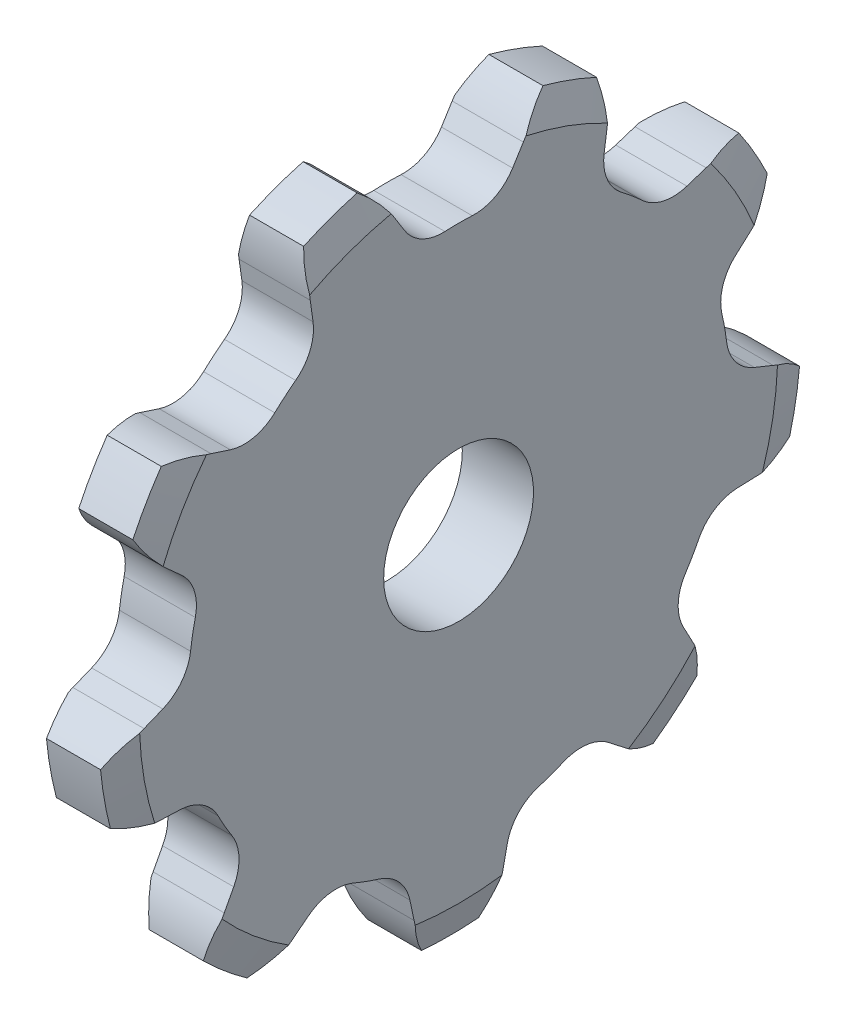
from build123d import *

# Parameters (mm, degrees)
TOOTHCUT_DEPTH  = 171.054362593
TEETHCUTS_COUNT = 9
TEETHCUTS_ANGLE = 320
BORSKE_R        = 25.4
BORE_DEPTH      = 76.2000508


with BuildPart() as part:
    # BasProSke → Base-Revolve (revolve)
    with BuildSketch(Plane(origin=(0, 0, 0), x_dir=(1, 0, 0), z_dir=(0, 1, 0)), mode=Mode.PRIVATE) as base_revolve_sk:
        Polygon((0, 0), (0, 108.223363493), (2.8956, 119.029889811), (21.2344, 119.029889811), (24.13, 108.223363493), (24.13, 0), align=None)
    revolve(base_revolve_sk.sketch.rotate(Axis((-10, 0, 0), (1, 0, 0)), 180), axis=Axis((-10, 0, 0), (1, 0, 0)))

    # TooCutSke → ToothCut (cut, through all)
    with BuildSketch(Plane(origin=(0, 0, 0), x_dir=(0, 0, -1), z_dir=(1, 0, 0))):
        with BuildLine():
            Line((-18.325370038, 98.612349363), (-21.959556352, 104.428263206))
            ThreePointArc((-21.959556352, 104.428263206), (-31.443843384, 114.743551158), (-44.015812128, 120.932449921))
            Line((-44.015812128, 120.932449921), (-48.359467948, 132.866546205))
            ThreePointArc((-48.359467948, 132.866546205), (0, 141.393625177), (48.359467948, 132.866546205))
            Line((48.359467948, 132.866546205), (44.015812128, 120.932449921))
            ThreePointArc((44.015812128, 120.932449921), (31.443843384, 114.743551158), (21.959556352, 104.428263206))
            Line((21.959556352, 104.428263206), (18.325370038, 98.612349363))
            ThreePointArc((18.325370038, 98.612349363), (12.450179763, 93.176534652), (4.630575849, 91.467810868))
            ThreePointArc((4.630575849, 91.467810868), (0, 91.584947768), (-4.630575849, 91.467810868))
            ThreePointArc((-4.630575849, 91.467810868), (-12.450179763, 93.176534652), (-18.325370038, 98.612349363))
        make_face()
    toothcut = extrude(amount=TOOTHCUT_DEPTH, mode=Mode.SUBTRACT)

    # TeethCuts: ToothCut ×9 about axis
    teethcuts_axis = Axis((-10, 0, 0), (1, 0, 0))
    for i in range(1, TEETHCUTS_COUNT):
        add(toothcut.rotate(teethcuts_axis, i * TEETHCUTS_ANGLE / (TEETHCUTS_COUNT - 1)), mode=Mode.SUBTRACT)

    # BorSke → Bore (cut, symmetric)
    with BuildSketch(Plane(origin=(0, 0, 0), x_dir=(0, 0, -1), z_dir=(1, 0, 0))):
        with Locations(Location((0, 0, 0), (0, 0, 180))):
            Circle(BORSKE_R)
    extrude(amount=BORE_DEPTH, both=True, mode=Mode.SUBTRACT)


solid = part.part
